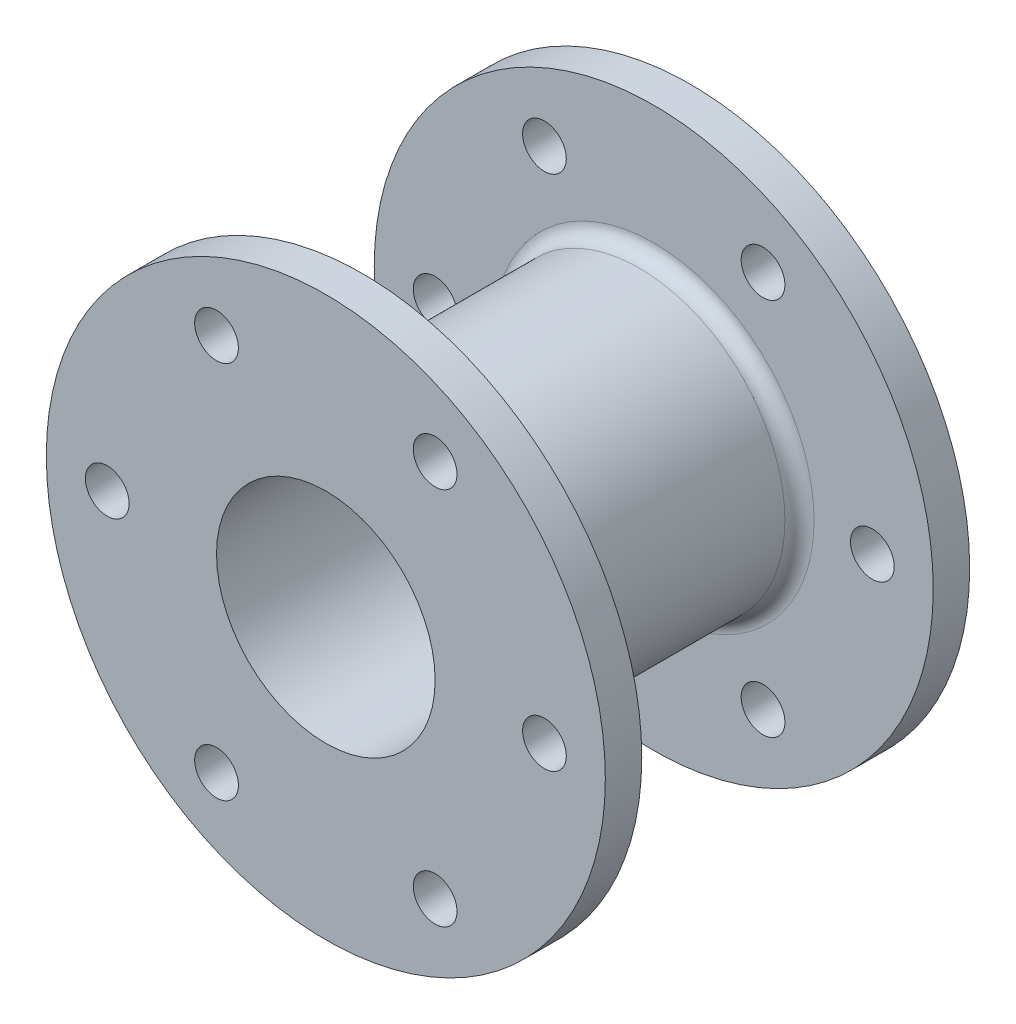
ISO-10303-21;
HEADER;
FILE_DESCRIPTION(('STEP AP214'),'2;1');
FILE_NAME('part.step','',(''),(''),'','','');
FILE_SCHEMA(('AUTOMOTIVE_DESIGN { 1 0 10303 214 1 1 1 1 }'));
ENDSEC;
DATA;
#1=APPLICATION_CONTEXT('core data for automotive mechanical design processes');
#2=APPLICATION_PROTOCOL_DEFINITION('international standard','automotive_design',2000,#1);
#3=PRODUCT_CONTEXT('',#1,'mechanical');
#4=PRODUCT('Part','Part','',(#3));
#5=PRODUCT_RELATED_PRODUCT_CATEGORY('part','',(#4));
#6=PRODUCT_DEFINITION_FORMATION('','',#4);
#7=PRODUCT_DEFINITION_CONTEXT('part definition',#1,'design');
#8=PRODUCT_DEFINITION('design','',#6,#7);
#9=PRODUCT_DEFINITION_SHAPE('','',#8);
#10=(LENGTH_UNIT() NAMED_UNIT(*) SI_UNIT(.MILLI.,.METRE.));
#11=(NAMED_UNIT(*) PLANE_ANGLE_UNIT() SI_UNIT($,.RADIAN.));
#12=(NAMED_UNIT(*) SI_UNIT($,.STERADIAN.) SOLID_ANGLE_UNIT());
#13=UNCERTAINTY_MEASURE_WITH_UNIT(LENGTH_MEASURE(1.E-05),#10,'distance_accuracy_value','');
#14=(GEOMETRIC_REPRESENTATION_CONTEXT(3) GLOBAL_UNCERTAINTY_ASSIGNED_CONTEXT((#13)) GLOBAL_UNIT_ASSIGNED_CONTEXT((#10,
#11,#12)) REPRESENTATION_CONTEXT('',''));
#15=CARTESIAN_POINT('',(0.,0.,0.));
#16=DIRECTION('',(0.,0.,1.));
#17=DIRECTION('',(1.,0.,0.));
#18=AXIS2_PLACEMENT_3D('',#15,#16,#17);
#19=CARTESIAN_POINT('',(0.,0.,50.));
#20=DIRECTION('',(0.,0.,-1.));
#21=DIRECTION('',(-1.,0.,0.));
#22=AXIS2_PLACEMENT_3D('',#19,#20,#21);
#23=CYLINDRICAL_SURFACE('',#22,20.);
#24=CARTESIAN_POINT('',(0.,0.,43.));
#25=DIRECTION('',(0.,0.,1.));
#26=DIRECTION('',(1.,0.,0.));
#27=AXIS2_PLACEMENT_3D('',#24,#25,#26);
#28=CIRCLE('',#27,20.);
#29=CARTESIAN_POINT('',(-20.,0.,43.));
#30=VERTEX_POINT('',#29);
#31=EDGE_CURVE('E50',#30,#30,#28,.F.);
#32=CARTESIAN_POINT('',(0.,0.,7.));
#33=DIRECTION('',(0.,0.,1.));
#34=DIRECTION('',(1.,0.,0.));
#35=AXIS2_PLACEMENT_3D('',#32,#33,#34);
#36=CIRCLE('',#35,20.);
#37=CARTESIAN_POINT('',(-20.,0.,6.99999999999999));
#38=VERTEX_POINT('',#37);
#39=EDGE_CURVE('E55',#38,#38,#36,.T.);
#40=CARTESIAN_POINT('',(-20.,0.,43.));
#41=CARTESIAN_POINT('',(-20.,0.,42.625));
#42=CARTESIAN_POINT('',(-20.,0.,42.25));
#43=CARTESIAN_POINT('',(-20.,0.,41.5));
#44=CARTESIAN_POINT('',(-20.,0.,41.125));
#45=CARTESIAN_POINT('',(-20.,0.,40.375));
#46=CARTESIAN_POINT('',(-20.,0.,40.));
#47=CARTESIAN_POINT('',(-20.,0.,39.25));
#48=CARTESIAN_POINT('',(-20.,0.,38.875));
#49=CARTESIAN_POINT('',(-20.,0.,38.125));
#50=CARTESIAN_POINT('',(-20.,0.,37.75));
#51=CARTESIAN_POINT('',(-20.,0.,37.));
#52=CARTESIAN_POINT('',(-20.,0.,36.625));
#53=CARTESIAN_POINT('',(-20.,0.,35.875));
#54=CARTESIAN_POINT('',(-20.,0.,35.5));
#55=CARTESIAN_POINT('',(-20.,0.,34.75));
#56=CARTESIAN_POINT('',(-20.,0.,34.375));
#57=CARTESIAN_POINT('',(-20.,0.,33.625));
#58=CARTESIAN_POINT('',(-20.,0.,33.25));
#59=CARTESIAN_POINT('',(-20.,0.,32.5));
#60=CARTESIAN_POINT('',(-20.,0.,32.125));
#61=CARTESIAN_POINT('',(-20.,0.,31.375));
#62=CARTESIAN_POINT('',(-20.,0.,31.));
#63=CARTESIAN_POINT('',(-20.,0.,30.25));
#64=CARTESIAN_POINT('',(-20.,0.,29.875));
#65=CARTESIAN_POINT('',(-20.,0.,29.125));
#66=CARTESIAN_POINT('',(-20.,0.,28.75));
#67=CARTESIAN_POINT('',(-20.,0.,28.));
#68=CARTESIAN_POINT('',(-20.,0.,27.625));
#69=CARTESIAN_POINT('',(-20.,0.,26.875));
#70=CARTESIAN_POINT('',(-20.,0.,26.5));
#71=CARTESIAN_POINT('',(-20.,0.,25.75));
#72=CARTESIAN_POINT('',(-20.,0.,25.375));
#73=CARTESIAN_POINT('',(-20.,0.,24.625));
#74=CARTESIAN_POINT('',(-20.,0.,24.25));
#75=CARTESIAN_POINT('',(-20.,0.,23.5));
#76=CARTESIAN_POINT('',(-20.,0.,23.125));
#77=CARTESIAN_POINT('',(-20.,0.,22.375));
#78=CARTESIAN_POINT('',(-20.,0.,22.));
#79=CARTESIAN_POINT('',(-20.,0.,21.25));
#80=CARTESIAN_POINT('',(-20.,0.,20.875));
#81=CARTESIAN_POINT('',(-20.,0.,20.125));
#82=CARTESIAN_POINT('',(-20.,0.,19.75));
#83=CARTESIAN_POINT('',(-20.,0.,19.));
#84=CARTESIAN_POINT('',(-20.,0.,18.625));
#85=CARTESIAN_POINT('',(-20.,0.,17.875));
#86=CARTESIAN_POINT('',(-20.,0.,17.5));
#87=CARTESIAN_POINT('',(-20.,0.,16.75));
#88=CARTESIAN_POINT('',(-20.,0.,16.375));
#89=CARTESIAN_POINT('',(-20.,0.,15.625));
#90=CARTESIAN_POINT('',(-20.,0.,15.25));
#91=CARTESIAN_POINT('',(-20.,0.,14.5));
#92=CARTESIAN_POINT('',(-20.,0.,14.125));
#93=CARTESIAN_POINT('',(-20.,0.,13.375));
#94=CARTESIAN_POINT('',(-20.,0.,13.));
#95=CARTESIAN_POINT('',(-20.,0.,12.25));
#96=CARTESIAN_POINT('',(-20.,0.,11.875));
#97=CARTESIAN_POINT('',(-20.,0.,11.125));
#98=CARTESIAN_POINT('',(-20.,0.,10.75));
#99=CARTESIAN_POINT('',(-20.,0.,9.99999999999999));
#100=CARTESIAN_POINT('',(-20.,0.,9.62499999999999));
#101=CARTESIAN_POINT('',(-20.,0.,8.87499999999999));
#102=CARTESIAN_POINT('',(-20.,0.,8.49999999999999));
#103=CARTESIAN_POINT('',(-20.,0.,7.74999999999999));
#104=CARTESIAN_POINT('',(-20.,0.,7.37499999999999));
#105=CARTESIAN_POINT('',(-20.,0.,6.99999999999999));
#106=B_SPLINE_CURVE_WITH_KNOTS('',3,(#40,#41,#42,#43,#44,#45,#46,#47,#48,#49,#50,#51,#52,#53,
#54,#55,#56,#57,#58,#59,#60,#61,#62,#63,#64,#65,#66,#67,#68,#69,#70,#71,#72,#73,#74,#75,#76,#77,
#78,#79,#80,#81,#82,#83,#84,#85,#86,#87,#88,#89,#90,#91,#92,#93,#94,#95,#96,#97,#98,#99,#100,
#101,#102,#103,#104,#105),.UNSPECIFIED.,.F.,.F.,(4,2,2,2,2,2,2,2,2,2,2,2,2,2,2,2,2,2,2,2,2,2,2,
2,2,2,2,2,2,2,2,2,4),(0.,1.12499999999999,2.25,3.375,4.5,5.625,6.75,7.875,9.,10.125,11.25,
12.375,13.5,14.625,15.75,16.875,18.,19.125,20.25,21.375,22.5,23.625,24.75,25.875,27.,28.125,
29.25,30.375,31.5,32.625,33.75,34.875,36.),.UNSPECIFIED.);
#107=EDGE_CURVE('BSEAM42',#30,#38,#106,.T.);
#108=ORIENTED_EDGE('',*,*,#31,.T.);
#109=ORIENTED_EDGE('',*,*,#39,.T.);
#110=ORIENTED_EDGE('',*,*,#107,.T.);
#111=ORIENTED_EDGE('',*,*,#107,.F.);
#112=EDGE_LOOP('',(#108,#110,#109,#111));
#113=FACE_BOUND('',#112,.T.);
#114=ADVANCED_FACE('F42',(#113),#23,.T.);
#115=CARTESIAN_POINT('',(0.,0.,5.));
#116=DIRECTION('',(0.,0.,1.));
#117=DIRECTION('',(1.,0.,0.));
#118=AXIS2_PLACEMENT_3D('',#115,#116,#117);
#119=PLANE('',#118);
#120=CARTESIAN_POINT('',(0.,0.,5.));
#121=DIRECTION('',(0.,0.,1.));
#122=DIRECTION('',(1.,0.,0.));
#123=AXIS2_PLACEMENT_3D('',#120,#121,#122);
#124=CIRCLE('',#123,22.);
#125=CARTESIAN_POINT('',(22.,0.,5.));
#126=VERTEX_POINT('',#125);
#127=EDGE_CURVE('E10',#126,#126,#124,.F.);
#128=ORIENTED_EDGE('',*,*,#127,.T.);
#129=EDGE_LOOP('',(#128));
#130=FACE_BOUND('',#129,.T.);
#131=CARTESIAN_POINT('',(14.9999999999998,-25.9807621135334,5.));
#132=DIRECTION('',(0.,0.,1.));
#133=DIRECTION('',(1.,0.,0.));
#134=AXIS2_PLACEMENT_3D('',#131,#132,#133);
#135=CIRCLE('',#134,3.);
#136=CARTESIAN_POINT('',(17.9999999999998,-25.9807621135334,5.));
#137=VERTEX_POINT('',#136);
#138=EDGE_CURVE('E109',#137,#137,#135,.T.);
#139=ORIENTED_EDGE('',*,*,#138,.F.);
#140=EDGE_LOOP('',(#139));
#141=FACE_BOUND('',#140,.T.);
#142=CARTESIAN_POINT('',(15.0000000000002,25.9807621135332,5.));
#143=DIRECTION('',(0.,0.,1.));
#144=DIRECTION('',(1.,0.,0.));
#145=AXIS2_PLACEMENT_3D('',#142,#143,#144);
#146=CIRCLE('',#145,3.00000000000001);
#147=CARTESIAN_POINT('',(18.0000000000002,25.9807621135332,5.));
#148=VERTEX_POINT('',#147);
#149=EDGE_CURVE('E93',#148,#148,#146,.T.);
#150=ORIENTED_EDGE('',*,*,#149,.F.);
#151=EDGE_LOOP('',(#150));
#152=FACE_BOUND('',#151,.T.);
#153=CARTESIAN_POINT('',(-30.0000000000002,0.,5.));
#154=DIRECTION('',(0.,0.,1.));
#155=DIRECTION('',(1.,0.,0.));
#156=AXIS2_PLACEMENT_3D('',#153,#154,#155);
#157=CIRCLE('',#156,3.);
#158=CARTESIAN_POINT('',(-27.0000000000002,0.,5.));
#159=VERTEX_POINT('',#158);
#160=EDGE_CURVE('E77',#159,#159,#157,.T.);
#161=ORIENTED_EDGE('',*,*,#160,.F.);
#162=EDGE_LOOP('',(#161));
#163=FACE_BOUND('',#162,.T.);
#164=CARTESIAN_POINT('',(0.,0.,5.));
#165=DIRECTION('',(0.,0.,1.));
#166=DIRECTION('',(1.,0.,0.));
#167=AXIS2_PLACEMENT_3D('',#164,#165,#166);
#168=CIRCLE('',#167,38.3580565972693);
#169=CARTESIAN_POINT('',(38.3580565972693,0.,5.));
#170=VERTEX_POINT('',#169);
#171=EDGE_CURVE('E66',#170,#170,#168,.T.);
#172=ORIENTED_EDGE('',*,*,#171,.T.);
#173=EDGE_LOOP('',(#172));
#174=FACE_BOUND('',#173,.T.);
#175=CARTESIAN_POINT('',(-15.,25.9807621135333,5.));
#176=DIRECTION('',(0.,0.,1.));
#177=DIRECTION('',(1.,0.,0.));
#178=AXIS2_PLACEMENT_3D('',#175,#176,#177);
#179=CIRCLE('',#178,3.00000000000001);
#180=CARTESIAN_POINT('',(-12.,25.9807621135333,5.));
#181=VERTEX_POINT('',#180);
#182=EDGE_CURVE('E85',#181,#181,#179,.T.);
#183=ORIENTED_EDGE('',*,*,#182,.F.);
#184=EDGE_LOOP('',(#183));
#185=FACE_BOUND('',#184,.T.);
#186=CARTESIAN_POINT('',(30.0000000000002,-2.09488880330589E-13,5.));
#187=DIRECTION('',(0.,0.,1.));
#188=DIRECTION('',(1.,0.,0.));
#189=AXIS2_PLACEMENT_3D('',#186,#187,#188);
#190=CIRCLE('',#189,3.00000000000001);
#191=CARTESIAN_POINT('',(33.0000000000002,-2.09488880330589E-13,5.));
#192=VERTEX_POINT('',#191);
#193=EDGE_CURVE('E101',#192,#192,#190,.T.);
#194=ORIENTED_EDGE('',*,*,#193,.F.);
#195=EDGE_LOOP('',(#194));
#196=FACE_BOUND('',#195,.T.);
#197=CARTESIAN_POINT('',(-15.0000000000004,-25.9807621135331,5.));
#198=DIRECTION('',(0.,0.,1.));
#199=DIRECTION('',(1.,0.,0.));
#200=AXIS2_PLACEMENT_3D('',#197,#198,#199);
#201=CIRCLE('',#200,3.00000000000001);
#202=CARTESIAN_POINT('',(-12.0000000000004,-25.9807621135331,5.));
#203=VERTEX_POINT('',#202);
#204=EDGE_CURVE('E117',#203,#203,#201,.T.);
#205=ORIENTED_EDGE('',*,*,#204,.F.);
#206=EDGE_LOOP('',(#205));
#207=FACE_BOUND('',#206,.T.);
#208=ADVANCED_FACE('F216',(#130,#141,#152,#163,#174,#185,#196,#207),#119,.T.);
#209=CARTESIAN_POINT('',(0.,0.,0.));
#210=DIRECTION('',(0.,0.,1.));
#211=DIRECTION('',(1.,0.,0.));
#212=AXIS2_PLACEMENT_3D('',#209,#210,#211);
#213=PLANE('',#212);
#214=CARTESIAN_POINT('',(0.,0.,0.));
#215=DIRECTION('',(0.,0.,1.));
#216=DIRECTION('',(1.,0.,0.));
#217=AXIS2_PLACEMENT_3D('',#214,#215,#216);
#218=CIRCLE('',#217,15.);
#219=CARTESIAN_POINT('',(-15.,0.,0.));
#220=VERTEX_POINT('',#219);
#221=EDGE_CURVE('E67',#220,#220,#218,.T.);
#222=ORIENTED_EDGE('',*,*,#221,.T.);
#223=EDGE_LOOP('',(#222));
#224=FACE_BOUND('',#223,.T.);
#225=CARTESIAN_POINT('',(0.,0.,0.));
#226=DIRECTION('',(0.,0.,1.));
#227=DIRECTION('',(1.,0.,0.));
#228=AXIS2_PLACEMENT_3D('',#225,#226,#227);
#229=CIRCLE('',#228,38.3580565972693);
#230=CARTESIAN_POINT('',(38.3580565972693,0.,0.));
#231=VERTEX_POINT('',#230);
#232=EDGE_CURVE('E73',#231,#231,#229,.T.);
#233=ORIENTED_EDGE('',*,*,#232,.F.);
#234=EDGE_LOOP('',(#233));
#235=FACE_BOUND('',#234,.T.);
#236=CARTESIAN_POINT('',(-30.0000000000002,0.,0.));
#237=DIRECTION('',(0.,0.,1.));
#238=DIRECTION('',(1.,0.,0.));
#239=AXIS2_PLACEMENT_3D('',#236,#237,#238);
#240=CIRCLE('',#239,3.);
#241=CARTESIAN_POINT('',(-27.0000000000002,0.,0.));
#242=VERTEX_POINT('',#241);
#243=EDGE_CURVE('E81',#242,#242,#240,.T.);
#244=ORIENTED_EDGE('',*,*,#243,.T.);
#245=EDGE_LOOP('',(#244));
#246=FACE_BOUND('',#245,.T.);
#247=CARTESIAN_POINT('',(-15.,25.9807621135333,0.));
#248=DIRECTION('',(0.,0.,1.));
#249=DIRECTION('',(1.,0.,0.));
#250=AXIS2_PLACEMENT_3D('',#247,#248,#249);
#251=CIRCLE('',#250,3.00000000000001);
#252=CARTESIAN_POINT('',(-12.,25.9807621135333,0.));
#253=VERTEX_POINT('',#252);
#254=EDGE_CURVE('E89',#253,#253,#251,.T.);
#255=ORIENTED_EDGE('',*,*,#254,.T.);
#256=EDGE_LOOP('',(#255));
#257=FACE_BOUND('',#256,.T.);
#258=CARTESIAN_POINT('',(15.0000000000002,25.9807621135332,0.));
#259=DIRECTION('',(0.,0.,1.));
#260=DIRECTION('',(1.,0.,0.));
#261=AXIS2_PLACEMENT_3D('',#258,#259,#260);
#262=CIRCLE('',#261,3.00000000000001);
#263=CARTESIAN_POINT('',(18.0000000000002,25.9807621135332,0.));
#264=VERTEX_POINT('',#263);
#265=EDGE_CURVE('E97',#264,#264,#262,.T.);
#266=ORIENTED_EDGE('',*,*,#265,.T.);
#267=EDGE_LOOP('',(#266));
#268=FACE_BOUND('',#267,.T.);
#269=CARTESIAN_POINT('',(30.0000000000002,-2.09488880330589E-13,0.));
#270=DIRECTION('',(0.,0.,1.));
#271=DIRECTION('',(1.,0.,0.));
#272=AXIS2_PLACEMENT_3D('',#269,#270,#271);
#273=CIRCLE('',#272,3.00000000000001);
#274=CARTESIAN_POINT('',(33.0000000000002,-2.09488880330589E-13,0.));
#275=VERTEX_POINT('',#274);
#276=EDGE_CURVE('E105',#275,#275,#273,.T.);
#277=ORIENTED_EDGE('',*,*,#276,.T.);
#278=EDGE_LOOP('',(#277));
#279=FACE_BOUND('',#278,.T.);
#280=CARTESIAN_POINT('',(14.9999999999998,-25.9807621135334,0.));
#281=DIRECTION('',(0.,0.,1.));
#282=DIRECTION('',(1.,0.,0.));
#283=AXIS2_PLACEMENT_3D('',#280,#281,#282);
#284=CIRCLE('',#283,3.);
#285=CARTESIAN_POINT('',(17.9999999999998,-25.9807621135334,0.));
#286=VERTEX_POINT('',#285);
#287=EDGE_CURVE('E113',#286,#286,#284,.T.);
#288=ORIENTED_EDGE('',*,*,#287,.T.);
#289=EDGE_LOOP('',(#288));
#290=FACE_BOUND('',#289,.T.);
#291=CARTESIAN_POINT('',(-15.0000000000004,-25.9807621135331,0.));
#292=DIRECTION('',(0.,0.,1.));
#293=DIRECTION('',(1.,0.,0.));
#294=AXIS2_PLACEMENT_3D('',#291,#292,#293);
#295=CIRCLE('',#294,3.00000000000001);
#296=CARTESIAN_POINT('',(-12.0000000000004,-25.9807621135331,0.));
#297=VERTEX_POINT('',#296);
#298=EDGE_CURVE('E121',#297,#297,#295,.T.);
#299=ORIENTED_EDGE('',*,*,#298,.T.);
#300=EDGE_LOOP('',(#299));
#301=FACE_BOUND('',#300,.T.);
#302=ADVANCED_FACE('F220',(#224,#235,#246,#257,#268,#279,#290,#301),#213,.F.);
#303=CARTESIAN_POINT('',(0.,0.,5.));
#304=DIRECTION('',(0.,0.,-1.));
#305=DIRECTION('',(-1.,0.,0.));
#306=AXIS2_PLACEMENT_3D('',#303,#304,#305);
#307=CYLINDRICAL_SURFACE('',#306,38.3580565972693);
#308=ORIENTED_EDGE('',*,*,#171,.F.);
#309=EDGE_LOOP('',(#308));
#310=FACE_BOUND('',#309,.T.);
#311=ORIENTED_EDGE('',*,*,#232,.T.);
#312=EDGE_LOOP('',(#311));
#313=FACE_BOUND('',#312,.T.);
#314=ADVANCED_FACE('F241',(#310,#313),#307,.T.);
#315=CARTESIAN_POINT('',(-30.0000000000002,0.,5.));
#316=DIRECTION('',(0.,0.,-1.));
#317=DIRECTION('',(-1.,0.,0.));
#318=AXIS2_PLACEMENT_3D('',#315,#316,#317);
#319=CYLINDRICAL_SURFACE('',#318,3.);
#320=ORIENTED_EDGE('',*,*,#160,.T.);
#321=EDGE_LOOP('',(#320));
#322=FACE_BOUND('',#321,.T.);
#323=ORIENTED_EDGE('',*,*,#243,.F.);
#324=EDGE_LOOP('',(#323));
#325=FACE_BOUND('',#324,.T.);
#326=ADVANCED_FACE('F238',(#322,#325),#319,.F.);
#327=CARTESIAN_POINT('',(-15.,25.9807621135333,5.));
#328=DIRECTION('',(0.,0.,-1.));
#329=DIRECTION('',(-1.,0.,0.));
#330=AXIS2_PLACEMENT_3D('',#327,#328,#329);
#331=CYLINDRICAL_SURFACE('',#330,3.00000000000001);
#332=ORIENTED_EDGE('',*,*,#182,.T.);
#333=EDGE_LOOP('',(#332));
#334=FACE_BOUND('',#333,.T.);
#335=ORIENTED_EDGE('',*,*,#254,.F.);
#336=EDGE_LOOP('',(#335));
#337=FACE_BOUND('',#336,.T.);
#338=ADVANCED_FACE('F234',(#334,#337),#331,.F.);
#339=CARTESIAN_POINT('',(15.0000000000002,25.9807621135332,5.));
#340=DIRECTION('',(0.,0.,-1.));
#341=DIRECTION('',(-1.,0.,0.));
#342=AXIS2_PLACEMENT_3D('',#339,#340,#341);
#343=CYLINDRICAL_SURFACE('',#342,3.00000000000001);
#344=ORIENTED_EDGE('',*,*,#149,.T.);
#345=EDGE_LOOP('',(#344));
#346=FACE_BOUND('',#345,.T.);
#347=ORIENTED_EDGE('',*,*,#265,.F.);
#348=EDGE_LOOP('',(#347));
#349=FACE_BOUND('',#348,.T.);
#350=ADVANCED_FACE('F230',(#346,#349),#343,.F.);
#351=CARTESIAN_POINT('',(30.0000000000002,-2.09488880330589E-13,5.));
#352=DIRECTION('',(0.,0.,-1.));
#353=DIRECTION('',(-1.,0.,0.));
#354=AXIS2_PLACEMENT_3D('',#351,#352,#353);
#355=CYLINDRICAL_SURFACE('',#354,3.00000000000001);
#356=ORIENTED_EDGE('',*,*,#193,.T.);
#357=EDGE_LOOP('',(#356));
#358=FACE_BOUND('',#357,.T.);
#359=ORIENTED_EDGE('',*,*,#276,.F.);
#360=EDGE_LOOP('',(#359));
#361=FACE_BOUND('',#360,.T.);
#362=ADVANCED_FACE('F226',(#358,#361),#355,.F.);
#363=CARTESIAN_POINT('',(14.9999999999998,-25.9807621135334,5.));
#364=DIRECTION('',(0.,0.,-1.));
#365=DIRECTION('',(-1.,0.,0.));
#366=AXIS2_PLACEMENT_3D('',#363,#364,#365);
#367=CYLINDRICAL_SURFACE('',#366,3.);
#368=ORIENTED_EDGE('',*,*,#138,.T.);
#369=EDGE_LOOP('',(#368));
#370=FACE_BOUND('',#369,.T.);
#371=ORIENTED_EDGE('',*,*,#287,.F.);
#372=EDGE_LOOP('',(#371));
#373=FACE_BOUND('',#372,.T.);
#374=ADVANCED_FACE('F209',(#370,#373),#367,.F.);
#375=CARTESIAN_POINT('',(-15.0000000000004,-25.9807621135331,5.));
#376=DIRECTION('',(0.,0.,-1.));
#377=DIRECTION('',(-1.,0.,0.));
#378=AXIS2_PLACEMENT_3D('',#375,#376,#377);
#379=CYLINDRICAL_SURFACE('',#378,3.00000000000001);
#380=ORIENTED_EDGE('',*,*,#204,.T.);
#381=EDGE_LOOP('',(#380));
#382=FACE_BOUND('',#381,.T.);
#383=ORIENTED_EDGE('',*,*,#298,.F.);
#384=EDGE_LOOP('',(#383));
#385=FACE_BOUND('',#384,.T.);
#386=ADVANCED_FACE('F200',(#382,#385),#379,.F.);
#387=CARTESIAN_POINT('',(0.,0.,50.));
#388=DIRECTION('',(0.,0.,1.));
#389=DIRECTION('',(1.,0.,0.));
#390=AXIS2_PLACEMENT_3D('',#387,#388,#389);
#391=PLANE('',#390);
#392=CARTESIAN_POINT('',(0.,0.,50.));
#393=DIRECTION('',(0.,0.,1.));
#394=DIRECTION('',(1.,0.,0.));
#395=AXIS2_PLACEMENT_3D('',#392,#393,#394);
#396=CIRCLE('',#395,15.);
#397=CARTESIAN_POINT('',(-15.,0.,50.));
#398=VERTEX_POINT('',#397);
#399=EDGE_CURVE('E71',#398,#398,#396,.T.);
#400=ORIENTED_EDGE('',*,*,#399,.F.);
#401=EDGE_LOOP('',(#400));
#402=FACE_BOUND('',#401,.T.);
#403=CARTESIAN_POINT('',(0.,0.,50.));
#404=DIRECTION('',(0.,0.,1.));
#405=DIRECTION('',(1.,0.,0.));
#406=AXIS2_PLACEMENT_3D('',#403,#404,#405);
#407=CIRCLE('',#406,38.3580565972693);
#408=CARTESIAN_POINT('',(38.3580565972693,0.,50.));
#409=VERTEX_POINT('',#408);
#410=EDGE_CURVE('E131',#409,#409,#407,.T.);
#411=ORIENTED_EDGE('',*,*,#410,.T.);
#412=EDGE_LOOP('',(#411));
#413=FACE_BOUND('',#412,.T.);
#414=CARTESIAN_POINT('',(-15.0000000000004,-25.9807621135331,50.));
#415=DIRECTION('',(0.,0.,1.));
#416=DIRECTION('',(1.,0.,0.));
#417=AXIS2_PLACEMENT_3D('',#414,#415,#416);
#418=CIRCLE('',#417,3.00000000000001);
#419=CARTESIAN_POINT('',(-12.0000000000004,-25.9807621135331,50.));
#420=VERTEX_POINT('',#419);
#421=EDGE_CURVE('E139',#420,#420,#418,.T.);
#422=ORIENTED_EDGE('',*,*,#421,.F.);
#423=EDGE_LOOP('',(#422));
#424=FACE_BOUND('',#423,.T.);
#425=CARTESIAN_POINT('',(14.9999999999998,-25.9807621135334,50.));
#426=DIRECTION('',(0.,0.,1.));
#427=DIRECTION('',(1.,0.,0.));
#428=AXIS2_PLACEMENT_3D('',#425,#426,#427);
#429=CIRCLE('',#428,3.);
#430=CARTESIAN_POINT('',(17.9999999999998,-25.9807621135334,50.));
#431=VERTEX_POINT('',#430);
#432=EDGE_CURVE('E147',#431,#431,#429,.T.);
#433=ORIENTED_EDGE('',*,*,#432,.F.);
#434=EDGE_LOOP('',(#433));
#435=FACE_BOUND('',#434,.T.);
#436=CARTESIAN_POINT('',(30.0000000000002,-2.09488880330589E-13,50.));
#437=DIRECTION('',(0.,0.,1.));
#438=DIRECTION('',(1.,0.,0.));
#439=AXIS2_PLACEMENT_3D('',#436,#437,#438);
#440=CIRCLE('',#439,3.);
#441=CARTESIAN_POINT('',(33.0000000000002,-2.09488880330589E-13,50.));
#442=VERTEX_POINT('',#441);
#443=EDGE_CURVE('E155',#442,#442,#440,.T.);
#444=ORIENTED_EDGE('',*,*,#443,.F.);
#445=EDGE_LOOP('',(#444));
#446=FACE_BOUND('',#445,.T.);
#447=CARTESIAN_POINT('',(15.0000000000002,25.9807621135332,50.));
#448=DIRECTION('',(0.,0.,1.));
#449=DIRECTION('',(1.,0.,0.));
#450=AXIS2_PLACEMENT_3D('',#447,#448,#449);
#451=CIRCLE('',#450,3.);
#452=CARTESIAN_POINT('',(18.0000000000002,25.9807621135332,50.));
#453=VERTEX_POINT('',#452);
#454=EDGE_CURVE('E163',#453,#453,#451,.T.);
#455=ORIENTED_EDGE('',*,*,#454,.F.);
#456=EDGE_LOOP('',(#455));
#457=FACE_BOUND('',#456,.T.);
#458=CARTESIAN_POINT('',(-15.,25.9807621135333,50.));
#459=DIRECTION('',(0.,0.,1.));
#460=DIRECTION('',(1.,0.,0.));
#461=AXIS2_PLACEMENT_3D('',#458,#459,#460);
#462=CIRCLE('',#461,3.00000000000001);
#463=CARTESIAN_POINT('',(-12.,25.9807621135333,50.));
#464=VERTEX_POINT('',#463);
#465=EDGE_CURVE('E171',#464,#464,#462,.T.);
#466=ORIENTED_EDGE('',*,*,#465,.F.);
#467=EDGE_LOOP('',(#466));
#468=FACE_BOUND('',#467,.T.);
#469=CARTESIAN_POINT('',(-30.0000000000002,0.,50.));
#470=DIRECTION('',(0.,0.,1.));
#471=DIRECTION('',(1.,0.,0.));
#472=AXIS2_PLACEMENT_3D('',#469,#470,#471);
#473=CIRCLE('',#472,3.);
#474=CARTESIAN_POINT('',(-27.0000000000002,0.,50.));
#475=VERTEX_POINT('',#474);
#476=EDGE_CURVE('E179',#475,#475,#473,.T.);
#477=ORIENTED_EDGE('',*,*,#476,.F.);
#478=EDGE_LOOP('',(#477));
#479=FACE_BOUND('',#478,.T.);
#480=ADVANCED_FACE('F197',(#402,#413,#424,#435,#446,#457,#468,#479),#391,.T.);
#481=CARTESIAN_POINT('',(0.,0.,50.));
#482=DIRECTION('',(0.,0.,-1.));
#483=DIRECTION('',(-1.,0.,0.));
#484=AXIS2_PLACEMENT_3D('',#481,#482,#483);
#485=CYLINDRICAL_SURFACE('',#484,15.);
#486=CARTESIAN_POINT('',(-15.,0.,50.));
#487=CARTESIAN_POINT('',(-15.,0.,49.4791666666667));
#488=CARTESIAN_POINT('',(-15.,0.,48.9583333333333));
#489=CARTESIAN_POINT('',(-15.,0.,47.9166666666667));
#490=CARTESIAN_POINT('',(-15.,0.,47.3958333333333));
#491=CARTESIAN_POINT('',(-15.,0.,46.3541666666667));
#492=CARTESIAN_POINT('',(-15.,0.,45.8333333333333));
#493=CARTESIAN_POINT('',(-15.,0.,44.7916666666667));
#494=CARTESIAN_POINT('',(-15.,0.,44.2708333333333));
#495=CARTESIAN_POINT('',(-15.,0.,43.2291666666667));
#496=CARTESIAN_POINT('',(-15.,0.,42.7083333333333));
#497=CARTESIAN_POINT('',(-15.,0.,41.6666666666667));
#498=CARTESIAN_POINT('',(-15.,0.,41.1458333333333));
#499=CARTESIAN_POINT('',(-15.,0.,40.1041666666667));
#500=CARTESIAN_POINT('',(-15.,0.,39.5833333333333));
#501=CARTESIAN_POINT('',(-15.,0.,38.5416666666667));
#502=CARTESIAN_POINT('',(-15.,0.,38.0208333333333));
#503=CARTESIAN_POINT('',(-15.,0.,36.9791666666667));
#504=CARTESIAN_POINT('',(-15.,0.,36.4583333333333));
#505=CARTESIAN_POINT('',(-15.,0.,35.4166666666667));
#506=CARTESIAN_POINT('',(-15.,0.,34.8958333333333));
#507=CARTESIAN_POINT('',(-15.,0.,33.8541666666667));
#508=CARTESIAN_POINT('',(-15.,0.,33.3333333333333));
#509=CARTESIAN_POINT('',(-15.,0.,32.2916666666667));
#510=CARTESIAN_POINT('',(-15.,0.,31.7708333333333));
#511=CARTESIAN_POINT('',(-15.,0.,30.7291666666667));
#512=CARTESIAN_POINT('',(-15.,0.,30.2083333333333));
#513=CARTESIAN_POINT('',(-15.,0.,29.1666666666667));
#514=CARTESIAN_POINT('',(-15.,0.,28.6458333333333));
#515=CARTESIAN_POINT('',(-15.,0.,27.6041666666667));
#516=CARTESIAN_POINT('',(-15.,0.,27.0833333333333));
#517=CARTESIAN_POINT('',(-15.,0.,26.0416666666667));
#518=CARTESIAN_POINT('',(-15.,0.,25.5208333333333));
#519=CARTESIAN_POINT('',(-15.,0.,24.4791666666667));
#520=CARTESIAN_POINT('',(-15.,0.,23.9583333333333));
#521=CARTESIAN_POINT('',(-15.,0.,22.9166666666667));
#522=CARTESIAN_POINT('',(-15.,0.,22.3958333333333));
#523=CARTESIAN_POINT('',(-15.,0.,21.3541666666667));
#524=CARTESIAN_POINT('',(-15.,0.,20.8333333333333));
#525=CARTESIAN_POINT('',(-15.,0.,19.7916666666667));
#526=CARTESIAN_POINT('',(-15.,0.,19.2708333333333));
#527=CARTESIAN_POINT('',(-15.,0.,18.2291666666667));
#528=CARTESIAN_POINT('',(-15.,0.,17.7083333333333));
#529=CARTESIAN_POINT('',(-15.,0.,16.6666666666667));
#530=CARTESIAN_POINT('',(-15.,0.,16.1458333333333));
#531=CARTESIAN_POINT('',(-15.,0.,15.1041666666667));
#532=CARTESIAN_POINT('',(-15.,0.,14.5833333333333));
#533=CARTESIAN_POINT('',(-15.,0.,13.5416666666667));
#534=CARTESIAN_POINT('',(-15.,0.,13.0208333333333));
#535=CARTESIAN_POINT('',(-15.,0.,11.9791666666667));
#536=CARTESIAN_POINT('',(-15.,0.,11.4583333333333));
#537=CARTESIAN_POINT('',(-15.,0.,10.4166666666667));
#538=CARTESIAN_POINT('',(-15.,0.,9.89583333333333));
#539=CARTESIAN_POINT('',(-15.,0.,8.85416666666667));
#540=CARTESIAN_POINT('',(-15.,0.,8.33333333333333));
#541=CARTESIAN_POINT('',(-15.,0.,7.29166666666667));
#542=CARTESIAN_POINT('',(-15.,0.,6.77083333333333));
#543=CARTESIAN_POINT('',(-15.,0.,5.72916666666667));
#544=CARTESIAN_POINT('',(-15.,0.,5.20833333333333));
#545=CARTESIAN_POINT('',(-15.,0.,4.16666666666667));
#546=CARTESIAN_POINT('',(-15.,0.,3.64583333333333));
#547=CARTESIAN_POINT('',(-15.,0.,2.60416666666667));
#548=CARTESIAN_POINT('',(-15.,0.,2.08333333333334));
#549=CARTESIAN_POINT('',(-15.,0.,1.04166666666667));
#550=CARTESIAN_POINT('',(-15.,0.,0.520833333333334));
#551=CARTESIAN_POINT('',(-15.,0.,0.));
#552=B_SPLINE_CURVE_WITH_KNOTS('',3,(#486,#487,#488,#489,#490,#491,#492,#493,#494,#495,#496,
#497,#498,#499,#500,#501,#502,#503,#504,#505,#506,#507,#508,#509,#510,#511,#512,#513,#514,#515,
#516,#517,#518,#519,#520,#521,#522,#523,#524,#525,#526,#527,#528,#529,#530,#531,#532,#533,#534,
#535,#536,#537,#538,#539,#540,#541,#542,#543,#544,#545,#546,#547,#548,#549,#550,#551),
.UNSPECIFIED.,.F.,.F.,(4,2,2,2,2,2,2,2,2,2,2,2,2,2,2,2,2,2,2,2,2,2,2,2,2,2,2,2,2,2,2,2,4),(0.,
1.56249999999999,3.125,4.6875,6.24999999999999,7.81249999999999,9.37499999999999,10.9375,12.5,
14.0625,15.625,17.1875,18.75,20.3125,21.875,23.4375,25.,26.5625,28.125,29.6875,31.25,32.8125,
34.375,35.9375,37.5,39.0625,40.625,42.1875,43.75,45.3125,46.875,48.4375,50.),.UNSPECIFIED.);
#553=EDGE_CURVE('BSEAM199',#398,#220,#552,.T.);
#554=ORIENTED_EDGE('',*,*,#399,.T.);
#555=ORIENTED_EDGE('',*,*,#221,.F.);
#556=ORIENTED_EDGE('',*,*,#553,.T.);
#557=ORIENTED_EDGE('',*,*,#553,.F.);
#558=EDGE_LOOP('',(#554,#556,#555,#557));
#559=FACE_BOUND('',#558,.T.);
#560=ADVANCED_FACE('F199',(#559),#485,.F.);
#561=CARTESIAN_POINT('',(0.,0.,45.));
#562=DIRECTION('',(0.,0.,1.));
#563=DIRECTION('',(1.,0.,0.));
#564=AXIS2_PLACEMENT_3D('',#561,#562,#563);
#565=PLANE('',#564);
#566=CARTESIAN_POINT('',(0.,0.,45.));
#567=DIRECTION('',(0.,0.,1.));
#568=DIRECTION('',(1.,0.,0.));
#569=AXIS2_PLACEMENT_3D('',#566,#567,#568);
#570=CIRCLE('',#569,22.);
#571=CARTESIAN_POINT('',(22.,0.,45.));
#572=VERTEX_POINT('',#571);
#573=EDGE_CURVE('E60',#572,#572,#570,.T.);
#574=ORIENTED_EDGE('',*,*,#573,.T.);
#575=EDGE_LOOP('',(#574));
#576=FACE_BOUND('',#575,.T.);
#577=CARTESIAN_POINT('',(0.,0.,45.));
#578=DIRECTION('',(0.,0.,1.));
#579=DIRECTION('',(1.,0.,0.));
#580=AXIS2_PLACEMENT_3D('',#577,#578,#579);
#581=CIRCLE('',#580,38.3580565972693);
#582=CARTESIAN_POINT('',(38.3580565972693,0.,45.));
#583=VERTEX_POINT('',#582);
#584=EDGE_CURVE('E72',#583,#583,#581,.T.);
#585=ORIENTED_EDGE('',*,*,#584,.F.);
#586=EDGE_LOOP('',(#585));
#587=FACE_BOUND('',#586,.T.);
#588=CARTESIAN_POINT('',(-15.0000000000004,-25.9807621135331,45.));
#589=DIRECTION('',(0.,0.,1.));
#590=DIRECTION('',(1.,0.,0.));
#591=AXIS2_PLACEMENT_3D('',#588,#589,#590);
#592=CIRCLE('',#591,3.00000000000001);
#593=CARTESIAN_POINT('',(-12.0000000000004,-25.9807621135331,45.));
#594=VERTEX_POINT('',#593);
#595=EDGE_CURVE('E135',#594,#594,#592,.T.);
#596=ORIENTED_EDGE('',*,*,#595,.T.);
#597=EDGE_LOOP('',(#596));
#598=FACE_BOUND('',#597,.T.);
#599=CARTESIAN_POINT('',(14.9999999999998,-25.9807621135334,45.));
#600=DIRECTION('',(0.,0.,1.));
#601=DIRECTION('',(1.,0.,0.));
#602=AXIS2_PLACEMENT_3D('',#599,#600,#601);
#603=CIRCLE('',#602,3.);
#604=CARTESIAN_POINT('',(17.9999999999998,-25.9807621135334,45.));
#605=VERTEX_POINT('',#604);
#606=EDGE_CURVE('E143',#605,#605,#603,.T.);
#607=ORIENTED_EDGE('',*,*,#606,.T.);
#608=EDGE_LOOP('',(#607));
#609=FACE_BOUND('',#608,.T.);
#610=CARTESIAN_POINT('',(30.0000000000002,-2.09488880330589E-13,45.));
#611=DIRECTION('',(0.,0.,1.));
#612=DIRECTION('',(1.,0.,0.));
#613=AXIS2_PLACEMENT_3D('',#610,#611,#612);
#614=CIRCLE('',#613,3.);
#615=CARTESIAN_POINT('',(33.0000000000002,-2.09488880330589E-13,45.));
#616=VERTEX_POINT('',#615);
#617=EDGE_CURVE('E151',#616,#616,#614,.T.);
#618=ORIENTED_EDGE('',*,*,#617,.T.);
#619=EDGE_LOOP('',(#618));
#620=FACE_BOUND('',#619,.T.);
#621=CARTESIAN_POINT('',(15.0000000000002,25.9807621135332,45.));
#622=DIRECTION('',(0.,0.,1.));
#623=DIRECTION('',(1.,0.,0.));
#624=AXIS2_PLACEMENT_3D('',#621,#622,#623);
#625=CIRCLE('',#624,3.);
#626=CARTESIAN_POINT('',(18.0000000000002,25.9807621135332,45.));
#627=VERTEX_POINT('',#626);
#628=EDGE_CURVE('E159',#627,#627,#625,.T.);
#629=ORIENTED_EDGE('',*,*,#628,.T.);
#630=EDGE_LOOP('',(#629));
#631=FACE_BOUND('',#630,.T.);
#632=CARTESIAN_POINT('',(-15.,25.9807621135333,45.));
#633=DIRECTION('',(0.,0.,1.));
#634=DIRECTION('',(1.,0.,0.));
#635=AXIS2_PLACEMENT_3D('',#632,#633,#634);
#636=CIRCLE('',#635,3.00000000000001);
#637=CARTESIAN_POINT('',(-12.,25.9807621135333,45.));
#638=VERTEX_POINT('',#637);
#639=EDGE_CURVE('E167',#638,#638,#636,.T.);
#640=ORIENTED_EDGE('',*,*,#639,.T.);
#641=EDGE_LOOP('',(#640));
#642=FACE_BOUND('',#641,.T.);
#643=CARTESIAN_POINT('',(-30.0000000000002,0.,45.));
#644=DIRECTION('',(0.,0.,1.));
#645=DIRECTION('',(1.,0.,0.));
#646=AXIS2_PLACEMENT_3D('',#643,#644,#645);
#647=CIRCLE('',#646,3.);
#648=CARTESIAN_POINT('',(-27.0000000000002,0.,45.));
#649=VERTEX_POINT('',#648);
#650=EDGE_CURVE('E175',#649,#649,#647,.T.);
#651=ORIENTED_EDGE('',*,*,#650,.T.);
#652=EDGE_LOOP('',(#651));
#653=FACE_BOUND('',#652,.T.);
#654=ADVANCED_FACE('F187',(#576,#587,#598,#609,#620,#631,#642,#653),#565,.F.);
#655=CARTESIAN_POINT('',(0.,0.,45.));
#656=DIRECTION('',(0.,0.,1.));
#657=DIRECTION('',(1.,0.,0.));
#658=AXIS2_PLACEMENT_3D('',#655,#656,#657);
#659=CYLINDRICAL_SURFACE('',#658,38.3580565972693);
#660=ORIENTED_EDGE('',*,*,#584,.T.);
#661=EDGE_LOOP('',(#660));
#662=FACE_BOUND('',#661,.T.);
#663=ORIENTED_EDGE('',*,*,#410,.F.);
#664=EDGE_LOOP('',(#663));
#665=FACE_BOUND('',#664,.T.);
#666=ADVANCED_FACE('F260',(#662,#665),#659,.T.);
#667=CARTESIAN_POINT('',(-15.0000000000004,-25.9807621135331,45.));
#668=DIRECTION('',(0.,0.,1.));
#669=DIRECTION('',(1.,0.,0.));
#670=AXIS2_PLACEMENT_3D('',#667,#668,#669);
#671=CYLINDRICAL_SURFACE('',#670,3.00000000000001);
#672=ORIENTED_EDGE('',*,*,#595,.F.);
#673=EDGE_LOOP('',(#672));
#674=FACE_BOUND('',#673,.T.);
#675=ORIENTED_EDGE('',*,*,#421,.T.);
#676=EDGE_LOOP('',(#675));
#677=FACE_BOUND('',#676,.T.);
#678=ADVANCED_FACE('F293',(#674,#677),#671,.F.);
#679=CARTESIAN_POINT('',(14.9999999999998,-25.9807621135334,45.));
#680=DIRECTION('',(0.,0.,1.));
#681=DIRECTION('',(1.,0.,0.));
#682=AXIS2_PLACEMENT_3D('',#679,#680,#681);
#683=CYLINDRICAL_SURFACE('',#682,3.);
#684=ORIENTED_EDGE('',*,*,#606,.F.);
#685=EDGE_LOOP('',(#684));
#686=FACE_BOUND('',#685,.T.);
#687=ORIENTED_EDGE('',*,*,#432,.T.);
#688=EDGE_LOOP('',(#687));
#689=FACE_BOUND('',#688,.T.);
#690=ADVANCED_FACE('F289',(#686,#689),#683,.F.);
#691=CARTESIAN_POINT('',(30.0000000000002,-2.09488880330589E-13,45.));
#692=DIRECTION('',(0.,0.,1.));
#693=DIRECTION('',(1.,0.,0.));
#694=AXIS2_PLACEMENT_3D('',#691,#692,#693);
#695=CYLINDRICAL_SURFACE('',#694,3.);
#696=ORIENTED_EDGE('',*,*,#617,.F.);
#697=EDGE_LOOP('',(#696));
#698=FACE_BOUND('',#697,.T.);
#699=ORIENTED_EDGE('',*,*,#443,.T.);
#700=EDGE_LOOP('',(#699));
#701=FACE_BOUND('',#700,.T.);
#702=ADVANCED_FACE('F283',(#698,#701),#695,.F.);
#703=CARTESIAN_POINT('',(15.0000000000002,25.9807621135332,45.));
#704=DIRECTION('',(0.,0.,1.));
#705=DIRECTION('',(1.,0.,0.));
#706=AXIS2_PLACEMENT_3D('',#703,#704,#705);
#707=CYLINDRICAL_SURFACE('',#706,3.);
#708=ORIENTED_EDGE('',*,*,#628,.F.);
#709=EDGE_LOOP('',(#708));
#710=FACE_BOUND('',#709,.T.);
#711=ORIENTED_EDGE('',*,*,#454,.T.);
#712=EDGE_LOOP('',(#711));
#713=FACE_BOUND('',#712,.T.);
#714=ADVANCED_FACE('F276',(#710,#713),#707,.F.);
#715=CARTESIAN_POINT('',(-15.,25.9807621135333,45.));
#716=DIRECTION('',(0.,0.,1.));
#717=DIRECTION('',(1.,0.,0.));
#718=AXIS2_PLACEMENT_3D('',#715,#716,#717);
#719=CYLINDRICAL_SURFACE('',#718,3.00000000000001);
#720=ORIENTED_EDGE('',*,*,#639,.F.);
#721=EDGE_LOOP('',(#720));
#722=FACE_BOUND('',#721,.T.);
#723=ORIENTED_EDGE('',*,*,#465,.T.);
#724=EDGE_LOOP('',(#723));
#725=FACE_BOUND('',#724,.T.);
#726=ADVANCED_FACE('F193',(#722,#725),#719,.F.);
#727=CARTESIAN_POINT('',(-30.0000000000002,0.,45.));
#728=DIRECTION('',(0.,0.,1.));
#729=DIRECTION('',(1.,0.,0.));
#730=AXIS2_PLACEMENT_3D('',#727,#728,#729);
#731=CYLINDRICAL_SURFACE('',#730,3.);
#732=ORIENTED_EDGE('',*,*,#650,.F.);
#733=EDGE_LOOP('',(#732));
#734=FACE_BOUND('',#733,.T.);
#735=ORIENTED_EDGE('',*,*,#476,.T.);
#736=EDGE_LOOP('',(#735));
#737=FACE_BOUND('',#736,.T.);
#738=ADVANCED_FACE('F189',(#734,#737),#731,.F.);
#739=CARTESIAN_POINT('',(0.,0.,43.));
#740=DIRECTION('',(0.,0.,1.));
#741=DIRECTION('',(1.,0.,0.));
#742=AXIS2_PLACEMENT_3D('',#739,#740,#741);
#743=TOROIDAL_SURFACE('',#742,22.,2.);
#744=ORIENTED_EDGE('',*,*,#31,.F.);
#745=EDGE_LOOP('',(#744));
#746=FACE_BOUND('',#745,.T.);
#747=ORIENTED_EDGE('',*,*,#573,.F.);
#748=EDGE_LOOP('',(#747));
#749=FACE_BOUND('',#748,.T.);
#750=ADVANCED_FACE('F192',(#746,#749),#743,.F.);
#751=CARTESIAN_POINT('',(0.,0.,7.));
#752=DIRECTION('',(0.,0.,1.));
#753=DIRECTION('',(1.,0.,0.));
#754=AXIS2_PLACEMENT_3D('',#751,#752,#753);
#755=TOROIDAL_SURFACE('',#754,22.,2.);
#756=ORIENTED_EDGE('',*,*,#127,.F.);
#757=EDGE_LOOP('',(#756));
#758=FACE_BOUND('',#757,.T.);
#759=ORIENTED_EDGE('',*,*,#39,.F.);
#760=EDGE_LOOP('',(#759));
#761=FACE_BOUND('',#760,.T.);
#762=ADVANCED_FACE('F44',(#758,#761),#755,.F.);
#763=CLOSED_SHELL('',(#114,#208,#302,#314,#326,#338,#350,#362,#374,#386,#480,#560,#654,#666,
#678,#690,#702,#714,#726,#738,#750,#762));
#764=MANIFOLD_SOLID_BREP('B2',#763);
#765=ADVANCED_BREP_SHAPE_REPRESENTATION('',(#18,#764),#14);
#766=SHAPE_DEFINITION_REPRESENTATION(#9,#765);
ENDSEC;
END-ISO-10303-21;
